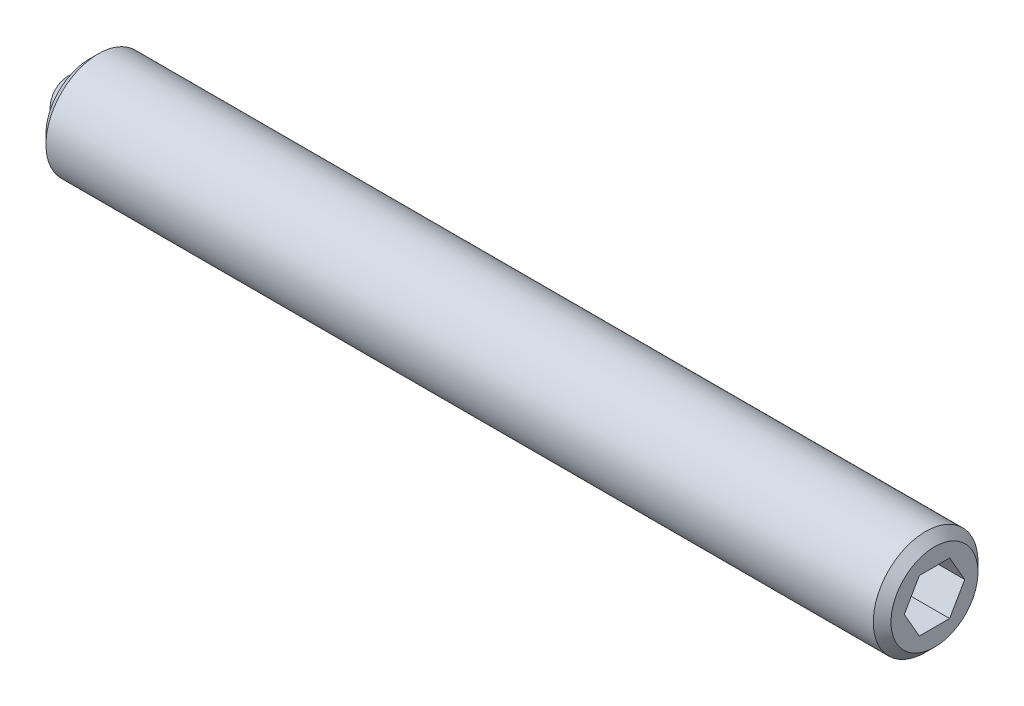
ISO-10303-21;
HEADER;
FILE_DESCRIPTION(('STEP AP214'),'2;1');
FILE_NAME('part.step','',(''),(''),'','','');
FILE_SCHEMA(('AUTOMOTIVE_DESIGN { 1 0 10303 214 1 1 1 1 }'));
ENDSEC;
DATA;
#1=APPLICATION_CONTEXT('core data for automotive mechanical design processes');
#2=APPLICATION_PROTOCOL_DEFINITION('international standard','automotive_design',2000,#1);
#3=PRODUCT_CONTEXT('',#1,'mechanical');
#4=PRODUCT('Part','Part','',(#3));
#5=PRODUCT_RELATED_PRODUCT_CATEGORY('part','',(#4));
#6=PRODUCT_DEFINITION_FORMATION('','',#4);
#7=PRODUCT_DEFINITION_CONTEXT('part definition',#1,'design');
#8=PRODUCT_DEFINITION('design','',#6,#7);
#9=PRODUCT_DEFINITION_SHAPE('','',#8);
#10=(LENGTH_UNIT() NAMED_UNIT(*) SI_UNIT(.MILLI.,.METRE.));
#11=(NAMED_UNIT(*) PLANE_ANGLE_UNIT() SI_UNIT($,.RADIAN.));
#12=(NAMED_UNIT(*) SI_UNIT($,.STERADIAN.) SOLID_ANGLE_UNIT());
#13=UNCERTAINTY_MEASURE_WITH_UNIT(LENGTH_MEASURE(1.E-05),#10,'distance_accuracy_value','');
#14=(GEOMETRIC_REPRESENTATION_CONTEXT(3) GLOBAL_UNCERTAINTY_ASSIGNED_CONTEXT((#13)) GLOBAL_UNIT_ASSIGNED_CONTEXT((#10,
#11,#12)) REPRESENTATION_CONTEXT('',''));
#15=CARTESIAN_POINT('',(0.,0.,0.));
#16=DIRECTION('',(0.,0.,1.));
#17=DIRECTION('',(1.,0.,0.));
#18=AXIS2_PLACEMENT_3D('',#15,#16,#17);
#19=CARTESIAN_POINT('',(0.,0.,0.));
#20=DIRECTION('',(0.,-1.,0.));
#21=DIRECTION('',(0.,0.,-1.));
#22=AXIS2_PLACEMENT_3D('',#19,#20,#21);
#23=SPHERICAL_SURFACE('',#22,0.8);
#24=CARTESIAN_POINT('',(0.,-0.8,0.));
#25=VERTEX_POINT('',#24);
#26=VERTEX_LOOP('',#25);
#27=FACE_BOUND('',#26,.T.);
#28=ADVANCED_FACE('F41',(#27),#23,.T.);
#29=CLOSED_SHELL('',(#28));
#30=MANIFOLD_SOLID_BREP('B2',#29);
#31=CARTESIAN_POINT('',(24.2,0.,0.));
#32=DIRECTION('',(-1.,0.,0.));
#33=DIRECTION('',(0.,0.,1.));
#34=AXIS2_PLACEMENT_3D('',#31,#32,#33);
#35=CYLINDRICAL_SURFACE('',#34,1.5);
#36=CARTESIAN_POINT('',(23.946,0.,0.));
#37=DIRECTION('',(1.,0.,0.));
#38=DIRECTION('',(0.,0.,-1.));
#39=AXIS2_PLACEMENT_3D('',#36,#37,#38);
#40=CIRCLE('',#39,1.5);
#41=CARTESIAN_POINT('',(23.946,0.,-1.5));
#42=VERTEX_POINT('',#41);
#43=EDGE_CURVE('E39',#42,#42,#40,.F.);
#44=ORIENTED_EDGE('',*,*,#43,.T.);
#45=EDGE_LOOP('',(#44));
#46=FACE_BOUND('',#45,.T.);
#47=CARTESIAN_POINT('',(0.254000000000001,0.,0.));
#48=DIRECTION('',(1.,0.,0.));
#49=DIRECTION('',(0.,0.,-1.));
#50=AXIS2_PLACEMENT_3D('',#47,#48,#49);
#51=CIRCLE('',#50,1.5);
#52=CARTESIAN_POINT('',(0.254000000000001,0.,-1.5));
#53=VERTEX_POINT('',#52);
#54=EDGE_CURVE('E176',#53,#53,#51,.T.);
#55=ORIENTED_EDGE('',*,*,#54,.T.);
#56=EDGE_LOOP('',(#55));
#57=FACE_BOUND('',#56,.T.);
#58=ADVANCED_FACE('F54',(#46,#57),#35,.T.);
#59=CARTESIAN_POINT('',(24.2,0.,0.));
#60=DIRECTION('',(1.,0.,0.));
#61=DIRECTION('',(0.,0.,-1.));
#62=AXIS2_PLACEMENT_3D('',#59,#60,#61);
#63=PLANE('',#62);
#64=DIRECTION('',(0.,0.866025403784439,-0.5));
#65=VECTOR('',#64,1.);
#66=CARTESIAN_POINT('',(24.2,-0.75,-0.43301270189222));
#67=LINE('',#66,#65);
#68=CARTESIAN_POINT('',(24.2,-0.75,-0.43301270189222));
#69=VERTEX_POINT('',#68);
#70=CARTESIAN_POINT('',(24.2,0.,-0.866025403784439));
#71=VERTEX_POINT('',#70);
#72=EDGE_CURVE('E77',#69,#71,#67,.T.);
#73=ORIENTED_EDGE('',*,*,#72,.F.);
#74=DIRECTION('',(0.,0.,-1.));
#75=VECTOR('',#74,1.);
#76=CARTESIAN_POINT('',(24.2,-0.75,0.433012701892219));
#77=LINE('',#76,#75);
#78=CARTESIAN_POINT('',(24.2,-0.75,0.433012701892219));
#79=VERTEX_POINT('',#78);
#80=EDGE_CURVE('E143',#79,#69,#77,.T.);
#81=ORIENTED_EDGE('',*,*,#80,.F.);
#82=DIRECTION('',(0.,-0.866025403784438,-0.5));
#83=VECTOR('',#82,1.);
#84=CARTESIAN_POINT('',(24.2,0.,0.866025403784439));
#85=LINE('',#84,#83);
#86=CARTESIAN_POINT('',(24.2,0.,0.866025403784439));
#87=VERTEX_POINT('',#86);
#88=EDGE_CURVE('E169',#87,#79,#85,.T.);
#89=ORIENTED_EDGE('',*,*,#88,.F.);
#90=DIRECTION('',(0.,-0.866025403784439,0.5));
#91=VECTOR('',#90,1.);
#92=CARTESIAN_POINT('',(24.2,0.75,0.433012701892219));
#93=LINE('',#92,#91);
#94=CARTESIAN_POINT('',(24.2,0.75,0.433012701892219));
#95=VERTEX_POINT('',#94);
#96=EDGE_CURVE('E166',#95,#87,#93,.T.);
#97=ORIENTED_EDGE('',*,*,#96,.F.);
#98=DIRECTION('',(0.,0.,1.));
#99=VECTOR('',#98,1.);
#100=CARTESIAN_POINT('',(24.2,0.75,-0.433012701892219));
#101=LINE('',#100,#99);
#102=CARTESIAN_POINT('',(24.2,0.75,-0.433012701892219));
#103=VERTEX_POINT('',#102);
#104=EDGE_CURVE('E163',#103,#95,#101,.T.);
#105=ORIENTED_EDGE('',*,*,#104,.F.);
#106=DIRECTION('',(0.,0.866025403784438,0.5));
#107=VECTOR('',#106,1.);
#108=CARTESIAN_POINT('',(24.2,0.,-0.866025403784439));
#109=LINE('',#108,#107);
#110=EDGE_CURVE('E160',#71,#103,#109,.T.);
#111=ORIENTED_EDGE('',*,*,#110,.F.);
#112=EDGE_LOOP('',(#73,#81,#89,#97,#105,#111));
#113=FACE_BOUND('',#112,.T.);
#114=CARTESIAN_POINT('',(24.2,0.,0.));
#115=DIRECTION('',(1.,0.,0.));
#116=DIRECTION('',(0.,0.,-1.));
#117=AXIS2_PLACEMENT_3D('',#114,#115,#116);
#118=CIRCLE('',#117,1.24599999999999);
#119=CARTESIAN_POINT('',(24.2,0.,-1.24599999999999));
#120=VERTEX_POINT('',#119);
#121=EDGE_CURVE('E62',#120,#120,#118,.T.);
#122=ORIENTED_EDGE('',*,*,#121,.T.);
#123=EDGE_LOOP('',(#122));
#124=FACE_BOUND('',#123,.T.);
#125=ADVANCED_FACE('F193',(#113,#124),#63,.T.);
#126=CARTESIAN_POINT('',(0.,0.,0.));
#127=DIRECTION('',(1.,0.,0.));
#128=DIRECTION('',(0.,0.,-1.));
#129=AXIS2_PLACEMENT_3D('',#126,#127,#128);
#130=PLANE('',#129);
#131=CARTESIAN_POINT('',(0.,0.,0.));
#132=DIRECTION('',(-1.,0.,0.));
#133=DIRECTION('',(0.,0.,1.));
#134=AXIS2_PLACEMENT_3D('',#131,#132,#133);
#135=CIRCLE('',#134,0.8);
#136=CARTESIAN_POINT('',(0.,0.79747984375,-0.0634499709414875));
#137=VERTEX_POINT('',#136);
#138=CARTESIAN_POINT('',(0.,0.79747984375,0.0634499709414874));
#139=VERTEX_POINT('',#138);
#140=EDGE_CURVE('E128',#137,#139,#135,.T.);
#141=ORIENTED_EDGE('',*,*,#140,.F.);
#142=CARTESIAN_POINT('',(0.,0.8,0.));
#143=DIRECTION('',(-1.,0.,0.));
#144=DIRECTION('',(0.,0.,1.));
#145=AXIS2_PLACEMENT_3D('',#142,#143,#144);
#146=CIRCLE('',#145,0.0635000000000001);
#147=EDGE_CURVE('E117',#139,#137,#146,.T.);
#148=ORIENTED_EDGE('',*,*,#147,.F.);
#149=EDGE_LOOP('',(#141,#148));
#150=FACE_BOUND('',#149,.T.);
#151=CARTESIAN_POINT('',(0.,0.,0.));
#152=DIRECTION('',(1.,0.,0.));
#153=DIRECTION('',(0.,0.,-1.));
#154=AXIS2_PLACEMENT_3D('',#151,#152,#153);
#155=CIRCLE('',#154,1.246);
#156=CARTESIAN_POINT('',(0.,0.,-1.246));
#157=VERTEX_POINT('',#156);
#158=EDGE_CURVE('E188',#157,#157,#155,.F.);
#159=ORIENTED_EDGE('',*,*,#158,.T.);
#160=EDGE_LOOP('',(#159));
#161=FACE_BOUND('',#160,.T.);
#162=ADVANCED_FACE('F132',(#150,#161),#130,.F.);
#163=CARTESIAN_POINT('',(0.254000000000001,0.,0.));
#164=DIRECTION('',(1.,0.,0.));
#165=DIRECTION('',(0.,0.,-1.));
#166=AXIS2_PLACEMENT_3D('',#163,#164,#165);
#167=CONICAL_SURFACE('',#166,1.5,0.785398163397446);
#168=ORIENTED_EDGE('',*,*,#158,.F.);
#169=EDGE_LOOP('',(#168));
#170=FACE_BOUND('',#169,.T.);
#171=ORIENTED_EDGE('',*,*,#54,.F.);
#172=EDGE_LOOP('',(#171));
#173=FACE_BOUND('',#172,.T.);
#174=ADVANCED_FACE('F197',(#170,#173),#167,.T.);
#175=CARTESIAN_POINT('',(24.2,0.,0.));
#176=DIRECTION('',(-1.,0.,0.));
#177=DIRECTION('',(0.,0.,1.));
#178=AXIS2_PLACEMENT_3D('',#175,#176,#177);
#179=CONICAL_SURFACE('',#178,1.24599999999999,0.785398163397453);
#180=ORIENTED_EDGE('',*,*,#43,.F.);
#181=EDGE_LOOP('',(#180));
#182=FACE_BOUND('',#181,.T.);
#183=ORIENTED_EDGE('',*,*,#121,.F.);
#184=EDGE_LOOP('',(#183));
#185=FACE_BOUND('',#184,.T.);
#186=ADVANCED_FACE('F56',(#182,#185),#179,.T.);
#187=CARTESIAN_POINT('',(22.2,-0.75,-0.43301270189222));
#188=DIRECTION('',(0.,-0.5,-0.866025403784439));
#189=DIRECTION('',(0.,0.866025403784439,-0.5));
#190=AXIS2_PLACEMENT_3D('',#187,#188,#189);
#191=PLANE('',#190);
#192=ORIENTED_EDGE('',*,*,#72,.T.);
#193=DIRECTION('',(1.,0.,0.));
#194=VECTOR('',#193,1.);
#195=CARTESIAN_POINT('',(22.2,0.,-0.866025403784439));
#196=LINE('',#195,#194);
#197=CARTESIAN_POINT('',(22.2,0.,-0.866025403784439));
#198=VERTEX_POINT('',#197);
#199=EDGE_CURVE('E158',#198,#71,#196,.T.);
#200=ORIENTED_EDGE('',*,*,#199,.F.);
#201=DIRECTION('',(0.,0.866025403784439,-0.5));
#202=VECTOR('',#201,1.);
#203=CARTESIAN_POINT('',(22.2,-0.75,-0.43301270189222));
#204=LINE('',#203,#202);
#205=CARTESIAN_POINT('',(22.2,-0.75,-0.43301270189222));
#206=VERTEX_POINT('',#205);
#207=EDGE_CURVE('E139',#206,#198,#204,.T.);
#208=ORIENTED_EDGE('',*,*,#207,.F.);
#209=DIRECTION('',(1.,0.,0.));
#210=VECTOR('',#209,1.);
#211=CARTESIAN_POINT('',(22.2,-0.75,-0.43301270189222));
#212=LINE('',#211,#210);
#213=EDGE_CURVE('E174',#206,#69,#212,.T.);
#214=ORIENTED_EDGE('',*,*,#213,.T.);
#215=EDGE_LOOP('',(#192,#200,#208,#214));
#216=FACE_BOUND('',#215,.T.);
#217=ADVANCED_FACE('F196',(#216),#191,.F.);
#218=CARTESIAN_POINT('',(22.2,-0.75,0.433012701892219));
#219=DIRECTION('',(0.,-1.,0.));
#220=DIRECTION('',(0.,0.,-1.));
#221=AXIS2_PLACEMENT_3D('',#218,#219,#220);
#222=PLANE('',#221);
#223=ORIENTED_EDGE('',*,*,#80,.T.);
#224=ORIENTED_EDGE('',*,*,#213,.F.);
#225=DIRECTION('',(0.,0.,-1.));
#226=VECTOR('',#225,1.);
#227=CARTESIAN_POINT('',(22.2,-0.75,0.433012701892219));
#228=LINE('',#227,#226);
#229=CARTESIAN_POINT('',(22.2,-0.75,0.433012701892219));
#230=VERTEX_POINT('',#229);
#231=EDGE_CURVE('E155',#230,#206,#228,.T.);
#232=ORIENTED_EDGE('',*,*,#231,.F.);
#233=DIRECTION('',(1.,0.,0.));
#234=VECTOR('',#233,1.);
#235=CARTESIAN_POINT('',(22.2,-0.75,0.433012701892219));
#236=LINE('',#235,#234);
#237=EDGE_CURVE('E177',#230,#79,#236,.T.);
#238=ORIENTED_EDGE('',*,*,#237,.T.);
#239=EDGE_LOOP('',(#223,#224,#232,#238));
#240=FACE_BOUND('',#239,.T.);
#241=ADVANCED_FACE('F203',(#240),#222,.F.);
#242=CARTESIAN_POINT('',(22.2,0.,0.866025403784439));
#243=DIRECTION('',(0.,-0.5,0.866025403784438));
#244=DIRECTION('',(0.,-0.866025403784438,-0.5));
#245=AXIS2_PLACEMENT_3D('',#242,#243,#244);
#246=PLANE('',#245);
#247=ORIENTED_EDGE('',*,*,#88,.T.);
#248=ORIENTED_EDGE('',*,*,#237,.F.);
#249=DIRECTION('',(0.,-0.866025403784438,-0.5));
#250=VECTOR('',#249,1.);
#251=CARTESIAN_POINT('',(22.2,0.,0.866025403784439));
#252=LINE('',#251,#250);
#253=CARTESIAN_POINT('',(22.2,0.,0.866025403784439));
#254=VERTEX_POINT('',#253);
#255=EDGE_CURVE('E152',#254,#230,#252,.T.);
#256=ORIENTED_EDGE('',*,*,#255,.F.);
#257=DIRECTION('',(1.,0.,0.));
#258=VECTOR('',#257,1.);
#259=CARTESIAN_POINT('',(22.2,0.,0.866025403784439));
#260=LINE('',#259,#258);
#261=EDGE_CURVE('E179',#254,#87,#260,.T.);
#262=ORIENTED_EDGE('',*,*,#261,.T.);
#263=EDGE_LOOP('',(#247,#248,#256,#262));
#264=FACE_BOUND('',#263,.T.);
#265=ADVANCED_FACE('F231',(#264),#246,.F.);
#266=CARTESIAN_POINT('',(22.2,0.75,0.433012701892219));
#267=DIRECTION('',(0.,0.5,0.866025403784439));
#268=DIRECTION('',(0.,-0.866025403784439,0.5));
#269=AXIS2_PLACEMENT_3D('',#266,#267,#268);
#270=PLANE('',#269);
#271=ORIENTED_EDGE('',*,*,#96,.T.);
#272=ORIENTED_EDGE('',*,*,#261,.F.);
#273=DIRECTION('',(0.,-0.866025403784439,0.5));
#274=VECTOR('',#273,1.);
#275=CARTESIAN_POINT('',(22.2,0.75,0.433012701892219));
#276=LINE('',#275,#274);
#277=CARTESIAN_POINT('',(22.2,0.75,0.433012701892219));
#278=VERTEX_POINT('',#277);
#279=EDGE_CURVE('E149',#278,#254,#276,.T.);
#280=ORIENTED_EDGE('',*,*,#279,.F.);
#281=DIRECTION('',(1.,0.,0.));
#282=VECTOR('',#281,1.);
#283=CARTESIAN_POINT('',(22.2,0.75,0.433012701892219));
#284=LINE('',#283,#282);
#285=EDGE_CURVE('E181',#278,#95,#284,.T.);
#286=ORIENTED_EDGE('',*,*,#285,.T.);
#287=EDGE_LOOP('',(#271,#272,#280,#286));
#288=FACE_BOUND('',#287,.T.);
#289=ADVANCED_FACE('F227',(#288),#270,.F.);
#290=CARTESIAN_POINT('',(22.2,0.75,-0.433012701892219));
#291=DIRECTION('',(0.,1.,0.));
#292=DIRECTION('',(0.,0.,1.));
#293=AXIS2_PLACEMENT_3D('',#290,#291,#292);
#294=PLANE('',#293);
#295=ORIENTED_EDGE('',*,*,#104,.T.);
#296=ORIENTED_EDGE('',*,*,#285,.F.);
#297=DIRECTION('',(0.,0.,1.));
#298=VECTOR('',#297,1.);
#299=CARTESIAN_POINT('',(22.2,0.75,-0.433012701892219));
#300=LINE('',#299,#298);
#301=CARTESIAN_POINT('',(22.2,0.75,-0.433012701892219));
#302=VERTEX_POINT('',#301);
#303=EDGE_CURVE('E146',#302,#278,#300,.T.);
#304=ORIENTED_EDGE('',*,*,#303,.F.);
#305=DIRECTION('',(1.,0.,0.));
#306=VECTOR('',#305,1.);
#307=CARTESIAN_POINT('',(22.2,0.75,-0.433012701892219));
#308=LINE('',#307,#306);
#309=EDGE_CURVE('E183',#302,#103,#308,.T.);
#310=ORIENTED_EDGE('',*,*,#309,.T.);
#311=EDGE_LOOP('',(#295,#296,#304,#310));
#312=FACE_BOUND('',#311,.T.);
#313=ADVANCED_FACE('F223',(#312),#294,.F.);
#314=CARTESIAN_POINT('',(22.2,0.,-0.866025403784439));
#315=DIRECTION('',(0.,0.500000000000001,-0.866025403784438));
#316=DIRECTION('',(0.,0.866025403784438,0.500000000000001));
#317=AXIS2_PLACEMENT_3D('',#314,#315,#316);
#318=PLANE('',#317);
#319=ORIENTED_EDGE('',*,*,#110,.T.);
#320=ORIENTED_EDGE('',*,*,#309,.F.);
#321=DIRECTION('',(0.,0.866025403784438,0.5));
#322=VECTOR('',#321,1.);
#323=CARTESIAN_POINT('',(22.2,0.,-0.866025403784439));
#324=LINE('',#323,#322);
#325=EDGE_CURVE('E142',#198,#302,#324,.T.);
#326=ORIENTED_EDGE('',*,*,#325,.F.);
#327=ORIENTED_EDGE('',*,*,#199,.T.);
#328=EDGE_LOOP('',(#319,#320,#326,#327));
#329=FACE_BOUND('',#328,.T.);
#330=ADVANCED_FACE('F219',(#329),#318,.F.);
#331=CARTESIAN_POINT('',(22.2,0.,0.));
#332=DIRECTION('',(1.,0.,0.));
#333=DIRECTION('',(0.,0.,-1.));
#334=AXIS2_PLACEMENT_3D('',#331,#332,#333);
#335=PLANE('',#334);
#336=ORIENTED_EDGE('',*,*,#207,.T.);
#337=ORIENTED_EDGE('',*,*,#325,.T.);
#338=ORIENTED_EDGE('',*,*,#303,.T.);
#339=ORIENTED_EDGE('',*,*,#279,.T.);
#340=ORIENTED_EDGE('',*,*,#255,.T.);
#341=ORIENTED_EDGE('',*,*,#231,.T.);
#342=EDGE_LOOP('',(#336,#337,#338,#339,#340,#341));
#343=FACE_BOUND('',#342,.T.);
#344=ADVANCED_FACE('F222',(#343),#335,.T.);
#345=CARTESIAN_POINT('',(0.8,0.,0.));
#346=DIRECTION('',(-1.,0.,0.));
#347=DIRECTION('',(0.,0.,1.));
#348=AXIS2_PLACEMENT_3D('',#345,#346,#347);
#349=CYLINDRICAL_SURFACE('',#348,0.8);
#350=CARTESIAN_POINT('',(0.8,0.,0.));
#351=DIRECTION('',(-1.,0.,0.));
#352=DIRECTION('',(0.,0.,1.));
#353=AXIS2_PLACEMENT_3D('',#350,#351,#352);
#354=CIRCLE('',#353,0.8);
#355=CARTESIAN_POINT('',(0.8,0.79747984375,-0.0634499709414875));
#356=VERTEX_POINT('',#355);
#357=CARTESIAN_POINT('',(0.8,0.79747984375,0.0634499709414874));
#358=VERTEX_POINT('',#357);
#359=EDGE_CURVE('E130',#356,#358,#354,.T.);
#360=ORIENTED_EDGE('',*,*,#359,.F.);
#361=DIRECTION('',(-1.,0.,0.));
#362=VECTOR('',#361,1.);
#363=CARTESIAN_POINT('',(0.94313511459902,0.79747984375,-0.0634499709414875));
#364=LINE('',#363,#362);
#365=EDGE_CURVE('E69',#356,#137,#364,.T.);
#366=ORIENTED_EDGE('',*,*,#365,.T.);
#367=ORIENTED_EDGE('',*,*,#140,.T.);
#368=DIRECTION('',(-1.,0.,0.));
#369=VECTOR('',#368,1.);
#370=CARTESIAN_POINT('',(0.94313511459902,0.79747984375,0.0634499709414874));
#371=LINE('',#370,#369);
#372=EDGE_CURVE('E120',#358,#139,#371,.T.);
#373=ORIENTED_EDGE('',*,*,#372,.F.);
#374=EDGE_LOOP('',(#360,#366,#367,#373));
#375=FACE_BOUND('',#374,.T.);
#376=ADVANCED_FACE('F127',(#375),#349,.F.);
#377=CARTESIAN_POINT('',(0.8,0.,0.));
#378=DIRECTION('',(-1.,0.,0.));
#379=DIRECTION('',(0.,0.,1.));
#380=AXIS2_PLACEMENT_3D('',#377,#378,#379);
#381=PLANE('',#380);
#382=ORIENTED_EDGE('',*,*,#359,.T.);
#383=CARTESIAN_POINT('',(0.8,0.8,0.));
#384=DIRECTION('',(-1.,0.,0.));
#385=DIRECTION('',(0.,0.,1.));
#386=AXIS2_PLACEMENT_3D('',#383,#384,#385);
#387=CIRCLE('',#386,0.0635000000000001);
#388=EDGE_CURVE('E134',#356,#358,#387,.F.);
#389=ORIENTED_EDGE('',*,*,#388,.F.);
#390=EDGE_LOOP('',(#382,#389));
#391=FACE_BOUND('',#390,.T.);
#392=ADVANCED_FACE('F244',(#391),#381,.T.);
#393=CARTESIAN_POINT('',(0.94313511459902,0.8,0.));
#394=DIRECTION('',(-1.,0.,0.));
#395=DIRECTION('',(0.,0.,1.));
#396=AXIS2_PLACEMENT_3D('',#393,#394,#395);
#397=CYLINDRICAL_SURFACE('',#396,0.0635000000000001);
#398=ORIENTED_EDGE('',*,*,#388,.T.);
#399=ORIENTED_EDGE('',*,*,#372,.T.);
#400=ORIENTED_EDGE('',*,*,#147,.T.);
#401=ORIENTED_EDGE('',*,*,#365,.F.);
#402=EDGE_LOOP('',(#398,#399,#400,#401));
#403=FACE_BOUND('',#402,.T.);
#404=ADVANCED_FACE('F118',(#403),#397,.F.);
#405=CLOSED_SHELL('',(#58,#125,#162,#174,#186,#217,#241,#265,#289,#313,#330,#344,#376,#392,#404));
#406=MANIFOLD_SOLID_BREP('B6',#405);
#407=ADVANCED_BREP_SHAPE_REPRESENTATION('',(#18,#30,#406),#14);
#408=SHAPE_DEFINITION_REPRESENTATION(#9,#407);
ENDSEC;
END-ISO-10303-21;
